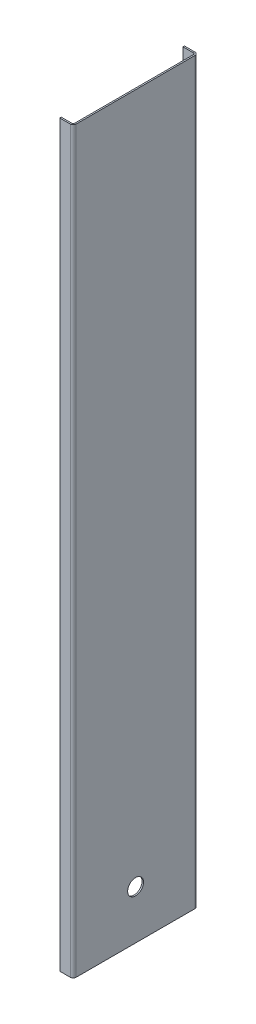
ISO-10303-21;
HEADER;
FILE_DESCRIPTION(('STEP AP214'),'2;1');
FILE_NAME('part.step','',(''),(''),'','','');
FILE_SCHEMA(('AUTOMOTIVE_DESIGN { 1 0 10303 214 1 1 1 1 }'));
ENDSEC;
DATA;
#1=APPLICATION_CONTEXT('core data for automotive mechanical design processes');
#2=APPLICATION_PROTOCOL_DEFINITION('international standard','automotive_design',2000,#1);
#3=PRODUCT_CONTEXT('',#1,'mechanical');
#4=PRODUCT('Part','Part','',(#3));
#5=PRODUCT_RELATED_PRODUCT_CATEGORY('part','',(#4));
#6=PRODUCT_DEFINITION_FORMATION('','',#4);
#7=PRODUCT_DEFINITION_CONTEXT('part definition',#1,'design');
#8=PRODUCT_DEFINITION('design','',#6,#7);
#9=PRODUCT_DEFINITION_SHAPE('','',#8);
#10=(LENGTH_UNIT() NAMED_UNIT(*) SI_UNIT(.MILLI.,.METRE.));
#11=(NAMED_UNIT(*) PLANE_ANGLE_UNIT() SI_UNIT($,.RADIAN.));
#12=(NAMED_UNIT(*) SI_UNIT($,.STERADIAN.) SOLID_ANGLE_UNIT());
#13=UNCERTAINTY_MEASURE_WITH_UNIT(LENGTH_MEASURE(1.E-05),#10,'distance_accuracy_value','');
#14=(GEOMETRIC_REPRESENTATION_CONTEXT(3) GLOBAL_UNCERTAINTY_ASSIGNED_CONTEXT((#13)) GLOBAL_UNIT_ASSIGNED_CONTEXT((#10,
#11,#12)) REPRESENTATION_CONTEXT('',''));
#15=CARTESIAN_POINT('',(0.,0.,0.));
#16=DIRECTION('',(0.,0.,1.));
#17=DIRECTION('',(1.,0.,0.));
#18=AXIS2_PLACEMENT_3D('',#15,#16,#17);
#19=CARTESIAN_POINT('',(430.000000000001,274.,102.3));
#20=DIRECTION('',(0.,-1.,0.));
#21=DIRECTION('',(0.,0.,-1.));
#22=AXIS2_PLACEMENT_3D('',#19,#20,#21);
#23=PLANE('',#22);
#24=DIRECTION('',(1.,0.,0.));
#25=VECTOR('',#24,1.);
#26=CARTESIAN_POINT('',(428.800000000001,274.,99.9000000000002));
#27=LINE('',#26,#25);
#28=CARTESIAN_POINT('',(428.800000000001,274.,99.9000000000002));
#29=VERTEX_POINT('',#28);
#30=CARTESIAN_POINT('',(430.000000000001,274.,99.9000000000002));
#31=VERTEX_POINT('',#30);
#32=EDGE_CURVE('E223',#29,#31,#27,.T.);
#33=ORIENTED_EDGE('',*,*,#32,.T.);
#34=DIRECTION('',(0.,0.,1.));
#35=VECTOR('',#34,1.);
#36=CARTESIAN_POINT('',(430.,274.,-1.42079482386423E-12));
#37=LINE('',#36,#35);
#38=CARTESIAN_POINT('',(430.,274.,2.39999999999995));
#39=VERTEX_POINT('',#38);
#40=EDGE_CURVE('E238',#39,#31,#37,.T.);
#41=ORIENTED_EDGE('',*,*,#40,.F.);
#42=DIRECTION('',(-1.,0.,0.));
#43=VECTOR('',#42,1.);
#44=CARTESIAN_POINT('',(428.8,274.,2.39999999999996));
#45=LINE('',#44,#43);
#46=CARTESIAN_POINT('',(428.8,274.,2.39999999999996));
#47=VERTEX_POINT('',#46);
#48=EDGE_CURVE('E246',#47,#39,#45,.F.);
#49=ORIENTED_EDGE('',*,*,#48,.F.);
#50=DIRECTION('',(0.,0.,-1.));
#51=VECTOR('',#50,1.);
#52=CARTESIAN_POINT('',(428.800000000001,274.,102.3));
#53=LINE('',#52,#51);
#54=EDGE_CURVE('E242',#47,#29,#53,.F.);
#55=ORIENTED_EDGE('',*,*,#54,.T.);
#56=EDGE_LOOP('',(#33,#41,#49,#55));
#57=FACE_BOUND('',#56,.T.);
#58=ADVANCED_FACE('F77',(#57),#23,.F.);
#59=CARTESIAN_POINT('',(430.,-332.3,1.2));
#60=DIRECTION('',(0.,1.,0.));
#61=DIRECTION('',(0.,0.,1.));
#62=AXIS2_PLACEMENT_3D('',#59,#60,#61);
#63=PLANE('',#62);
#64=DIRECTION('',(1.,-1.85037170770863E-13,0.));
#65=VECTOR('',#64,1.);
#66=CARTESIAN_POINT('',(428.800000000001,-332.3,99.9000000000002));
#67=LINE('',#66,#65);
#68=CARTESIAN_POINT('',(428.800000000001,-332.3,99.9000000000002));
#69=VERTEX_POINT('',#68);
#70=CARTESIAN_POINT('',(430.000000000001,-332.3,99.9000000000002));
#71=VERTEX_POINT('',#70);
#72=EDGE_CURVE('E229',#69,#71,#67,.T.);
#73=ORIENTED_EDGE('',*,*,#72,.F.);
#74=DIRECTION('',(0.,0.,1.));
#75=VECTOR('',#74,1.);
#76=CARTESIAN_POINT('',(428.8,-332.3,1.2));
#77=LINE('',#76,#75);
#78=CARTESIAN_POINT('',(428.8,-332.3,2.39999999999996));
#79=VERTEX_POINT('',#78);
#80=EDGE_CURVE('E240',#69,#79,#77,.F.);
#81=ORIENTED_EDGE('',*,*,#80,.T.);
#82=DIRECTION('',(-1.,0.,0.));
#83=VECTOR('',#82,1.);
#84=CARTESIAN_POINT('',(430.,-332.3,2.39999999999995));
#85=LINE('',#84,#83);
#86=CARTESIAN_POINT('',(430.,-332.3,2.39999999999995));
#87=VERTEX_POINT('',#86);
#88=EDGE_CURVE('E232',#79,#87,#85,.F.);
#89=ORIENTED_EDGE('',*,*,#88,.T.);
#90=DIRECTION('',(0.,0.,-1.));
#91=VECTOR('',#90,1.);
#92=CARTESIAN_POINT('',(430.,-332.3,-1.42079482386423E-12));
#93=LINE('',#92,#91);
#94=EDGE_CURVE('E235',#71,#87,#93,.T.);
#95=ORIENTED_EDGE('',*,*,#94,.F.);
#96=EDGE_LOOP('',(#73,#81,#89,#95));
#97=FACE_BOUND('',#96,.T.);
#98=ADVANCED_FACE('F355',(#97),#63,.F.);
#99=CARTESIAN_POINT('',(430.,0.,-1.42079482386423E-12));
#100=DIRECTION('',(-1.,0.,0.));
#101=DIRECTION('',(0.,0.,1.));
#102=AXIS2_PLACEMENT_3D('',#99,#100,#101);
#103=PLANE('',#102);
#104=CARTESIAN_POINT('',(430.,-292.3,51.1500000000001));
#105=DIRECTION('',(-1.,0.,0.));
#106=DIRECTION('',(0.,0.,1.));
#107=AXIS2_PLACEMENT_3D('',#104,#105,#106);
#108=CIRCLE('',#107,6.50000000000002);
#109=CARTESIAN_POINT('',(430.,-292.3,57.6500000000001));
#110=VERTEX_POINT('',#109);
#111=EDGE_CURVE('E220',#110,#110,#108,.T.);
#112=ORIENTED_EDGE('',*,*,#111,.T.);
#113=EDGE_LOOP('',(#112));
#114=FACE_BOUND('',#113,.T.);
#115=DIRECTION('',(0.,1.,0.));
#116=VECTOR('',#115,1.);
#117=CARTESIAN_POINT('',(430.000000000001,274.,99.9000000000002));
#118=LINE('',#117,#116);
#119=EDGE_CURVE('E176',#31,#71,#118,.F.);
#120=ORIENTED_EDGE('',*,*,#119,.T.);
#121=ORIENTED_EDGE('',*,*,#94,.T.);
#122=DIRECTION('',(0.,1.,0.));
#123=VECTOR('',#122,1.);
#124=CARTESIAN_POINT('',(430.,-332.3,2.39999999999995));
#125=LINE('',#124,#123);
#126=EDGE_CURVE('E244',#39,#87,#125,.F.);
#127=ORIENTED_EDGE('',*,*,#126,.F.);
#128=ORIENTED_EDGE('',*,*,#40,.T.);
#129=EDGE_LOOP('',(#120,#121,#127,#128));
#130=FACE_BOUND('',#129,.T.);
#131=ADVANCED_FACE('F340',(#114,#130),#103,.F.);
#132=CARTESIAN_POINT('',(428.8,0.,-1.41660504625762E-12));
#133=DIRECTION('',(-1.,0.,0.));
#134=DIRECTION('',(0.,0.,1.));
#135=AXIS2_PLACEMENT_3D('',#132,#133,#134);
#136=PLANE('',#135);
#137=CARTESIAN_POINT('',(428.8,-292.3,51.1500000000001));
#138=DIRECTION('',(-1.,0.,0.));
#139=DIRECTION('',(0.,0.,1.));
#140=AXIS2_PLACEMENT_3D('',#137,#138,#139);
#141=CIRCLE('',#140,6.50000000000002);
#142=CARTESIAN_POINT('',(428.8,-292.3,57.6500000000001));
#143=VERTEX_POINT('',#142);
#144=EDGE_CURVE('E334',#143,#143,#141,.T.);
#145=ORIENTED_EDGE('',*,*,#144,.F.);
#146=EDGE_LOOP('',(#145));
#147=FACE_BOUND('',#146,.T.);
#148=ORIENTED_EDGE('',*,*,#80,.F.);
#149=DIRECTION('',(0.,1.,0.));
#150=VECTOR('',#149,1.);
#151=CARTESIAN_POINT('',(428.800000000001,274.,99.9000000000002));
#152=LINE('',#151,#150);
#153=EDGE_CURVE('E92',#29,#69,#152,.F.);
#154=ORIENTED_EDGE('',*,*,#153,.F.);
#155=ORIENTED_EDGE('',*,*,#54,.F.);
#156=DIRECTION('',(0.,1.,0.));
#157=VECTOR('',#156,1.);
#158=CARTESIAN_POINT('',(428.8,-332.3,2.39999999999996));
#159=LINE('',#158,#157);
#160=EDGE_CURVE('E249',#79,#47,#159,.T.);
#161=ORIENTED_EDGE('',*,*,#160,.F.);
#162=EDGE_LOOP('',(#148,#154,#155,#161));
#163=FACE_BOUND('',#162,.T.);
#164=ADVANCED_FACE('F313',(#147,#163),#136,.T.);
#165=CARTESIAN_POINT('',(419.,-332.3,1.2));
#166=DIRECTION('',(0.,1.,0.));
#167=DIRECTION('',(0.,0.,1.));
#168=AXIS2_PLACEMENT_3D('',#165,#166,#167);
#169=PLANE('',#168);
#170=DIRECTION('',(0.,0.,-1.));
#171=VECTOR('',#170,1.);
#172=CARTESIAN_POINT('',(427.6,-332.3,1.19999999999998));
#173=LINE('',#172,#171);
#174=CARTESIAN_POINT('',(427.6,-332.3,1.19999999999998));
#175=VERTEX_POINT('',#174);
#176=CARTESIAN_POINT('',(427.6,-332.3,0.));
#177=VERTEX_POINT('',#176);
#178=EDGE_CURVE('E268',#175,#177,#173,.T.);
#179=ORIENTED_EDGE('',*,*,#178,.F.);
#180=DIRECTION('',(1.,0.,0.));
#181=VECTOR('',#180,1.);
#182=CARTESIAN_POINT('',(419.,-332.3,1.2));
#183=LINE('',#182,#181);
#184=CARTESIAN_POINT('',(419.,-332.3,1.2));
#185=VERTEX_POINT('',#184);
#186=EDGE_CURVE('E276',#185,#175,#183,.T.);
#187=ORIENTED_EDGE('',*,*,#186,.F.);
#188=DIRECTION('',(0.,0.,-1.));
#189=VECTOR('',#188,1.);
#190=CARTESIAN_POINT('',(419.,-332.3,1.2));
#191=LINE('',#190,#189);
#192=CARTESIAN_POINT('',(419.,-332.3,0.));
#193=VERTEX_POINT('',#192);
#194=EDGE_CURVE('E13',#185,#193,#191,.T.);
#195=ORIENTED_EDGE('',*,*,#194,.T.);
#196=DIRECTION('',(1.,0.,0.));
#197=VECTOR('',#196,1.);
#198=CARTESIAN_POINT('',(419.,-332.3,0.));
#199=LINE('',#198,#197);
#200=EDGE_CURVE('E284',#193,#177,#199,.T.);
#201=ORIENTED_EDGE('',*,*,#200,.T.);
#202=EDGE_LOOP('',(#179,#187,#195,#201));
#203=FACE_BOUND('',#202,.T.);
#204=ADVANCED_FACE('F300',(#203),#169,.F.);
#205=CARTESIAN_POINT('',(419.,274.,1.2));
#206=DIRECTION('',(0.,-1.,0.));
#207=DIRECTION('',(0.,0.,-1.));
#208=AXIS2_PLACEMENT_3D('',#205,#206,#207);
#209=PLANE('',#208);
#210=DIRECTION('',(0.,0.,-1.));
#211=VECTOR('',#210,1.);
#212=CARTESIAN_POINT('',(427.6,274.,1.19999999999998));
#213=LINE('',#212,#211);
#214=CARTESIAN_POINT('',(427.6,274.,1.19999999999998));
#215=VERTEX_POINT('',#214);
#216=CARTESIAN_POINT('',(427.6,274.,0.));
#217=VERTEX_POINT('',#216);
#218=EDGE_CURVE('E258',#215,#217,#213,.T.);
#219=ORIENTED_EDGE('',*,*,#218,.T.);
#220=DIRECTION('',(-1.,0.,0.));
#221=VECTOR('',#220,1.);
#222=CARTESIAN_POINT('',(419.,274.,0.));
#223=LINE('',#222,#221);
#224=CARTESIAN_POINT('',(419.,274.,0.));
#225=VERTEX_POINT('',#224);
#226=EDGE_CURVE('E277',#217,#225,#223,.T.);
#227=ORIENTED_EDGE('',*,*,#226,.T.);
#228=DIRECTION('',(0.,0.,-1.));
#229=VECTOR('',#228,1.);
#230=CARTESIAN_POINT('',(419.,274.,1.2));
#231=LINE('',#230,#229);
#232=CARTESIAN_POINT('',(419.,274.,1.2));
#233=VERTEX_POINT('',#232);
#234=EDGE_CURVE('E85',#233,#225,#231,.T.);
#235=ORIENTED_EDGE('',*,*,#234,.F.);
#236=DIRECTION('',(-1.,0.,0.));
#237=VECTOR('',#236,1.);
#238=CARTESIAN_POINT('',(419.,274.,1.2));
#239=LINE('',#238,#237);
#240=EDGE_CURVE('E280',#215,#233,#239,.T.);
#241=ORIENTED_EDGE('',*,*,#240,.F.);
#242=EDGE_LOOP('',(#219,#227,#235,#241));
#243=FACE_BOUND('',#242,.T.);
#244=ADVANCED_FACE('F304',(#243),#209,.F.);
#245=CARTESIAN_POINT('',(0.,0.,1.2));
#246=DIRECTION('',(0.,0.,-1.));
#247=DIRECTION('',(-1.,0.,0.));
#248=AXIS2_PLACEMENT_3D('',#245,#246,#247);
#249=PLANE('',#248);
#250=DIRECTION('',(0.,1.,0.));
#251=VECTOR('',#250,1.);
#252=CARTESIAN_POINT('',(427.6,274.,1.19999999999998));
#253=LINE('',#252,#251);
#254=EDGE_CURVE('E264',#215,#175,#253,.F.);
#255=ORIENTED_EDGE('',*,*,#254,.F.);
#256=ORIENTED_EDGE('',*,*,#240,.T.);
#257=DIRECTION('',(0.,-1.,0.));
#258=VECTOR('',#257,1.);
#259=CARTESIAN_POINT('',(419.,-332.3,1.2));
#260=LINE('',#259,#258);
#261=EDGE_CURVE('E273',#233,#185,#260,.T.);
#262=ORIENTED_EDGE('',*,*,#261,.T.);
#263=ORIENTED_EDGE('',*,*,#186,.T.);
#264=EDGE_LOOP('',(#255,#256,#262,#263));
#265=FACE_BOUND('',#264,.T.);
#266=ADVANCED_FACE('F303',(#265),#249,.F.);
#267=CARTESIAN_POINT('',(0.,0.,0.));
#268=DIRECTION('',(0.,0.,-1.));
#269=DIRECTION('',(-1.,0.,0.));
#270=AXIS2_PLACEMENT_3D('',#267,#268,#269);
#271=PLANE('',#270);
#272=ORIENTED_EDGE('',*,*,#226,.F.);
#273=DIRECTION('',(0.,1.,0.));
#274=VECTOR('',#273,1.);
#275=CARTESIAN_POINT('',(427.6,274.,0.));
#276=LINE('',#275,#274);
#277=EDGE_CURVE('E253',#217,#177,#276,.F.);
#278=ORIENTED_EDGE('',*,*,#277,.T.);
#279=ORIENTED_EDGE('',*,*,#200,.F.);
#280=DIRECTION('',(0.,-1.,0.));
#281=VECTOR('',#280,1.);
#282=CARTESIAN_POINT('',(419.,-332.3,0.));
#283=LINE('',#282,#281);
#284=EDGE_CURVE('E270',#225,#193,#283,.T.);
#285=ORIENTED_EDGE('',*,*,#284,.F.);
#286=EDGE_LOOP('',(#272,#278,#279,#285));
#287=FACE_BOUND('',#286,.T.);
#288=ADVANCED_FACE('F297',(#287),#271,.T.);
#289=CARTESIAN_POINT('',(419.,-332.3,1.2));
#290=DIRECTION('',(1.,0.,0.));
#291=DIRECTION('',(0.,0.,-1.));
#292=AXIS2_PLACEMENT_3D('',#289,#290,#291);
#293=PLANE('',#292);
#294=ORIENTED_EDGE('',*,*,#284,.T.);
#295=ORIENTED_EDGE('',*,*,#194,.F.);
#296=ORIENTED_EDGE('',*,*,#261,.F.);
#297=ORIENTED_EDGE('',*,*,#234,.T.);
#298=EDGE_LOOP('',(#294,#295,#296,#297));
#299=FACE_BOUND('',#298,.T.);
#300=ADVANCED_FACE('F79',(#299),#293,.F.);
#301=CARTESIAN_POINT('',(427.6,-332.3,2.39999999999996));
#302=DIRECTION('',(0.,-1.,0.));
#303=DIRECTION('',(0.,0.,-1.));
#304=AXIS2_PLACEMENT_3D('',#301,#302,#303);
#305=PLANE('',#304);
#306=ORIENTED_EDGE('',*,*,#88,.F.);
#307=CARTESIAN_POINT('',(427.6,-332.3,2.39999999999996));
#308=DIRECTION('',(0.,1.,0.));
#309=DIRECTION('',(0.,0.,1.));
#310=AXIS2_PLACEMENT_3D('',#307,#308,#309);
#311=CIRCLE('',#310,1.19999999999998);
#312=EDGE_CURVE('E261',#175,#79,#311,.F.);
#313=ORIENTED_EDGE('',*,*,#312,.F.);
#314=ORIENTED_EDGE('',*,*,#178,.T.);
#315=CARTESIAN_POINT('',(427.6,-332.3,2.39999999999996));
#316=DIRECTION('',(0.,1.,0.));
#317=DIRECTION('',(0.,0.,1.));
#318=AXIS2_PLACEMENT_3D('',#315,#316,#317);
#319=CIRCLE('',#318,2.39999999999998);
#320=EDGE_CURVE('E100',#177,#87,#319,.F.);
#321=ORIENTED_EDGE('',*,*,#320,.T.);
#322=EDGE_LOOP('',(#306,#313,#314,#321));
#323=FACE_BOUND('',#322,.T.);
#324=ADVANCED_FACE('F371',(#323),#305,.T.);
#325=CARTESIAN_POINT('',(427.6,274.,2.39999999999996));
#326=DIRECTION('',(0.,-1.,0.));
#327=DIRECTION('',(0.,0.,-1.));
#328=AXIS2_PLACEMENT_3D('',#325,#326,#327);
#329=PLANE('',#328);
#330=CARTESIAN_POINT('',(427.6,274.,2.39999999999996));
#331=DIRECTION('',(0.,1.,0.));
#332=DIRECTION('',(0.,0.,1.));
#333=AXIS2_PLACEMENT_3D('',#330,#331,#332);
#334=CIRCLE('',#333,1.19999999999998);
#335=EDGE_CURVE('E237',#47,#215,#334,.T.);
#336=ORIENTED_EDGE('',*,*,#335,.F.);
#337=ORIENTED_EDGE('',*,*,#48,.T.);
#338=CARTESIAN_POINT('',(427.6,274.,2.39999999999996));
#339=DIRECTION('',(0.,1.,0.));
#340=DIRECTION('',(0.,0.,1.));
#341=AXIS2_PLACEMENT_3D('',#338,#339,#340);
#342=CIRCLE('',#341,2.39999999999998);
#343=EDGE_CURVE('E256',#39,#217,#342,.T.);
#344=ORIENTED_EDGE('',*,*,#343,.T.);
#345=ORIENTED_EDGE('',*,*,#218,.F.);
#346=EDGE_LOOP('',(#336,#337,#344,#345));
#347=FACE_BOUND('',#346,.T.);
#348=ADVANCED_FACE('F307',(#347),#329,.F.);
#349=CARTESIAN_POINT('',(427.6,274.,2.39999999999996));
#350=DIRECTION('',(0.,1.,0.));
#351=DIRECTION('',(1.,0.,0.));
#352=AXIS2_PLACEMENT_3D('',#349,#350,#351);
#353=CYLINDRICAL_SURFACE('',#352,2.39999999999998);
#354=ORIENTED_EDGE('',*,*,#277,.F.);
#355=ORIENTED_EDGE('',*,*,#343,.F.);
#356=ORIENTED_EDGE('',*,*,#126,.T.);
#357=ORIENTED_EDGE('',*,*,#320,.F.);
#358=EDGE_LOOP('',(#354,#355,#356,#357));
#359=FACE_BOUND('',#358,.T.);
#360=ADVANCED_FACE('F365',(#359),#353,.T.);
#361=CARTESIAN_POINT('',(427.6,274.,2.39999999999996));
#362=DIRECTION('',(0.,1.,0.));
#363=DIRECTION('',(1.,0.,0.));
#364=AXIS2_PLACEMENT_3D('',#361,#362,#363);
#365=CYLINDRICAL_SURFACE('',#364,1.19999999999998);
#366=ORIENTED_EDGE('',*,*,#254,.T.);
#367=ORIENTED_EDGE('',*,*,#312,.T.);
#368=ORIENTED_EDGE('',*,*,#160,.T.);
#369=ORIENTED_EDGE('',*,*,#335,.T.);
#370=EDGE_LOOP('',(#366,#367,#368,#369));
#371=FACE_BOUND('',#370,.T.);
#372=ADVANCED_FACE('F310',(#371),#365,.F.);
#373=CARTESIAN_POINT('',(427.600000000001,-332.3,99.9000000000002));
#374=DIRECTION('',(0.,-1.,0.));
#375=DIRECTION('',(0.,0.,-1.));
#376=AXIS2_PLACEMENT_3D('',#373,#374,#375);
#377=PLANE('',#376);
#378=DIRECTION('',(0.,0.,1.));
#379=VECTOR('',#378,1.);
#380=CARTESIAN_POINT('',(427.600000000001,-332.3,102.3));
#381=LINE('',#380,#379);
#382=CARTESIAN_POINT('',(427.600000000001,-332.3,101.1));
#383=VERTEX_POINT('',#382);
#384=CARTESIAN_POINT('',(427.600000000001,-332.3,102.3));
#385=VERTEX_POINT('',#384);
#386=EDGE_CURVE('E217',#383,#385,#381,.T.);
#387=ORIENTED_EDGE('',*,*,#386,.F.);
#388=CARTESIAN_POINT('',(427.600000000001,-332.3,99.9000000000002));
#389=DIRECTION('',(0.,1.,0.));
#390=DIRECTION('',(0.,0.,1.));
#391=AXIS2_PLACEMENT_3D('',#388,#389,#390);
#392=CIRCLE('',#391,1.20000000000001);
#393=EDGE_CURVE('E179',#69,#383,#392,.F.);
#394=ORIENTED_EDGE('',*,*,#393,.F.);
#395=ORIENTED_EDGE('',*,*,#72,.T.);
#396=CARTESIAN_POINT('',(427.600000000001,-332.3,99.9000000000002));
#397=DIRECTION('',(0.,1.,0.));
#398=DIRECTION('',(0.,0.,1.));
#399=AXIS2_PLACEMENT_3D('',#396,#397,#398);
#400=CIRCLE('',#399,2.40000000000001);
#401=EDGE_CURVE('E222',#71,#385,#400,.F.);
#402=ORIENTED_EDGE('',*,*,#401,.T.);
#403=EDGE_LOOP('',(#387,#394,#395,#402));
#404=FACE_BOUND('',#403,.T.);
#405=ADVANCED_FACE('F370',(#404),#377,.T.);
#406=CARTESIAN_POINT('',(427.600000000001,274.,99.9000000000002));
#407=DIRECTION('',(0.,-1.,0.));
#408=DIRECTION('',(0.,0.,-1.));
#409=AXIS2_PLACEMENT_3D('',#406,#407,#408);
#410=PLANE('',#409);
#411=CARTESIAN_POINT('',(427.600000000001,274.,99.9000000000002));
#412=DIRECTION('',(0.,1.,0.));
#413=DIRECTION('',(0.,0.,1.));
#414=AXIS2_PLACEMENT_3D('',#411,#412,#413);
#415=CIRCLE('',#414,1.20000000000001);
#416=CARTESIAN_POINT('',(427.600000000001,274.,101.1));
#417=VERTEX_POINT('',#416);
#418=EDGE_CURVE('E186',#417,#29,#415,.T.);
#419=ORIENTED_EDGE('',*,*,#418,.F.);
#420=DIRECTION('',(0.,0.,1.));
#421=VECTOR('',#420,1.);
#422=CARTESIAN_POINT('',(427.600000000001,274.,101.1));
#423=LINE('',#422,#421);
#424=CARTESIAN_POINT('',(427.600000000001,274.,102.3));
#425=VERTEX_POINT('',#424);
#426=EDGE_CURVE('E183',#417,#425,#423,.T.);
#427=ORIENTED_EDGE('',*,*,#426,.T.);
#428=CARTESIAN_POINT('',(427.600000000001,274.,99.9000000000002));
#429=DIRECTION('',(0.,1.,0.));
#430=DIRECTION('',(0.,0.,1.));
#431=AXIS2_PLACEMENT_3D('',#428,#429,#430);
#432=CIRCLE('',#431,2.40000000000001);
#433=EDGE_CURVE('E169',#425,#31,#432,.T.);
#434=ORIENTED_EDGE('',*,*,#433,.T.);
#435=ORIENTED_EDGE('',*,*,#32,.F.);
#436=EDGE_LOOP('',(#419,#427,#434,#435));
#437=FACE_BOUND('',#436,.T.);
#438=ADVANCED_FACE('F184',(#437),#410,.F.);
#439=CARTESIAN_POINT('',(427.600000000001,274.,99.9000000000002));
#440=DIRECTION('',(0.,1.,0.));
#441=DIRECTION('',(0.,0.,1.));
#442=AXIS2_PLACEMENT_3D('',#439,#440,#441);
#443=CYLINDRICAL_SURFACE('',#442,2.40000000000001);
#444=ORIENTED_EDGE('',*,*,#119,.F.);
#445=ORIENTED_EDGE('',*,*,#433,.F.);
#446=DIRECTION('',(0.,1.,0.));
#447=VECTOR('',#446,1.);
#448=CARTESIAN_POINT('',(427.600000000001,0.,102.3));
#449=LINE('',#448,#447);
#450=EDGE_CURVE('E174',#385,#425,#449,.T.);
#451=ORIENTED_EDGE('',*,*,#450,.F.);
#452=ORIENTED_EDGE('',*,*,#401,.F.);
#453=EDGE_LOOP('',(#444,#445,#451,#452));
#454=FACE_BOUND('',#453,.T.);
#455=ADVANCED_FACE('F171',(#454),#443,.T.);
#456=CARTESIAN_POINT('',(427.600000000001,274.,99.9000000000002));
#457=DIRECTION('',(0.,1.,0.));
#458=DIRECTION('',(0.,0.,1.));
#459=AXIS2_PLACEMENT_3D('',#456,#457,#458);
#460=CYLINDRICAL_SURFACE('',#459,1.20000000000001);
#461=ORIENTED_EDGE('',*,*,#153,.T.);
#462=ORIENTED_EDGE('',*,*,#393,.T.);
#463=DIRECTION('',(0.,-1.,0.));
#464=VECTOR('',#463,1.);
#465=CARTESIAN_POINT('',(427.600000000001,-332.3,101.1));
#466=LINE('',#465,#464);
#467=EDGE_CURVE('E191',#383,#417,#466,.F.);
#468=ORIENTED_EDGE('',*,*,#467,.T.);
#469=ORIENTED_EDGE('',*,*,#418,.T.);
#470=EDGE_LOOP('',(#461,#462,#468,#469));
#471=FACE_BOUND('',#470,.T.);
#472=ADVANCED_FACE('F317',(#471),#460,.F.);
#473=CARTESIAN_POINT('',(428.800000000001,274.,102.3));
#474=DIRECTION('',(0.,1.,0.));
#475=DIRECTION('',(0.,0.,1.));
#476=AXIS2_PLACEMENT_3D('',#473,#474,#475);
#477=PLANE('',#476);
#478=DIRECTION('',(1.,0.,0.));
#479=VECTOR('',#478,1.);
#480=CARTESIAN_POINT('',(428.800000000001,274.,102.3));
#481=LINE('',#480,#479);
#482=CARTESIAN_POINT('',(419.,274.,102.3));
#483=VERTEX_POINT('',#482);
#484=EDGE_CURVE('E198',#483,#425,#481,.T.);
#485=ORIENTED_EDGE('',*,*,#484,.T.);
#486=ORIENTED_EDGE('',*,*,#426,.F.);
#487=DIRECTION('',(-1.,0.,0.));
#488=VECTOR('',#487,1.);
#489=CARTESIAN_POINT('',(7.20382241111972E-13,274.,101.100000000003));
#490=LINE('',#489,#488);
#491=CARTESIAN_POINT('',(419.,274.,101.1));
#492=VERTEX_POINT('',#491);
#493=EDGE_CURVE('E201',#492,#417,#490,.F.);
#494=ORIENTED_EDGE('',*,*,#493,.F.);
#495=DIRECTION('',(0.,0.,-1.));
#496=VECTOR('',#495,1.);
#497=CARTESIAN_POINT('',(419.,274.,102.3));
#498=LINE('',#497,#496);
#499=EDGE_CURVE('E204',#483,#492,#498,.T.);
#500=ORIENTED_EDGE('',*,*,#499,.F.);
#501=EDGE_LOOP('',(#485,#486,#494,#500));
#502=FACE_BOUND('',#501,.T.);
#503=ADVANCED_FACE('F203',(#502),#477,.T.);
#504=CARTESIAN_POINT('',(419.,-332.3,102.3));
#505=DIRECTION('',(0.,-1.,0.));
#506=DIRECTION('',(0.,0.,-1.));
#507=AXIS2_PLACEMENT_3D('',#504,#505,#506);
#508=PLANE('',#507);
#509=DIRECTION('',(1.,0.,0.));
#510=VECTOR('',#509,1.);
#511=CARTESIAN_POINT('',(7.20382241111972E-13,-332.3,101.100000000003));
#512=LINE('',#511,#510);
#513=CARTESIAN_POINT('',(419.,-332.3,101.1));
#514=VERTEX_POINT('',#513);
#515=EDGE_CURVE('E210',#383,#514,#512,.F.);
#516=ORIENTED_EDGE('',*,*,#515,.F.);
#517=ORIENTED_EDGE('',*,*,#386,.T.);
#518=DIRECTION('',(-1.,0.,0.));
#519=VECTOR('',#518,1.);
#520=CARTESIAN_POINT('',(419.,-332.3,102.3));
#521=LINE('',#520,#519);
#522=CARTESIAN_POINT('',(419.,-332.3,102.3));
#523=VERTEX_POINT('',#522);
#524=EDGE_CURVE('E200',#385,#523,#521,.T.);
#525=ORIENTED_EDGE('',*,*,#524,.T.);
#526=DIRECTION('',(0.,0.,-1.));
#527=VECTOR('',#526,1.);
#528=CARTESIAN_POINT('',(419.,-332.3,102.3));
#529=LINE('',#528,#527);
#530=EDGE_CURVE('E327',#523,#514,#529,.T.);
#531=ORIENTED_EDGE('',*,*,#530,.T.);
#532=EDGE_LOOP('',(#516,#517,#525,#531));
#533=FACE_BOUND('',#532,.T.);
#534=ADVANCED_FACE('F325',(#533),#508,.T.);
#535=CARTESIAN_POINT('',(7.28525335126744E-13,0.,102.300000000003));
#536=DIRECTION('',(0.,0.,1.));
#537=DIRECTION('',(1.,0.,0.));
#538=AXIS2_PLACEMENT_3D('',#535,#536,#537);
#539=PLANE('',#538);
#540=ORIENTED_EDGE('',*,*,#524,.F.);
#541=ORIENTED_EDGE('',*,*,#450,.T.);
#542=ORIENTED_EDGE('',*,*,#484,.F.);
#543=DIRECTION('',(0.,1.,0.));
#544=VECTOR('',#543,1.);
#545=CARTESIAN_POINT('',(419.,274.,102.3));
#546=LINE('',#545,#544);
#547=EDGE_CURVE('E207',#523,#483,#546,.T.);
#548=ORIENTED_EDGE('',*,*,#547,.F.);
#549=EDGE_LOOP('',(#540,#541,#542,#548));
#550=FACE_BOUND('',#549,.T.);
#551=ADVANCED_FACE('F196',(#550),#539,.T.);
#552=CARTESIAN_POINT('',(7.20382241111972E-13,0.,101.100000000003));
#553=DIRECTION('',(0.,0.,1.));
#554=DIRECTION('',(1.,0.,0.));
#555=AXIS2_PLACEMENT_3D('',#552,#553,#554);
#556=PLANE('',#555);
#557=ORIENTED_EDGE('',*,*,#467,.F.);
#558=ORIENTED_EDGE('',*,*,#515,.T.);
#559=DIRECTION('',(0.,-1.,0.));
#560=VECTOR('',#559,1.);
#561=CARTESIAN_POINT('',(419.,0.,101.1));
#562=LINE('',#561,#560);
#563=EDGE_CURVE('E205',#514,#492,#562,.F.);
#564=ORIENTED_EDGE('',*,*,#563,.T.);
#565=ORIENTED_EDGE('',*,*,#493,.T.);
#566=EDGE_LOOP('',(#557,#558,#564,#565));
#567=FACE_BOUND('',#566,.T.);
#568=ADVANCED_FACE('F322',(#567),#556,.F.);
#569=CARTESIAN_POINT('',(419.,274.,102.3));
#570=DIRECTION('',(-1.,0.,0.));
#571=DIRECTION('',(0.,0.,1.));
#572=AXIS2_PLACEMENT_3D('',#569,#570,#571);
#573=PLANE('',#572);
#574=ORIENTED_EDGE('',*,*,#563,.F.);
#575=ORIENTED_EDGE('',*,*,#530,.F.);
#576=ORIENTED_EDGE('',*,*,#547,.T.);
#577=ORIENTED_EDGE('',*,*,#499,.T.);
#578=EDGE_LOOP('',(#574,#575,#576,#577));
#579=FACE_BOUND('',#578,.T.);
#580=ADVANCED_FACE('F331',(#579),#573,.T.);
#581=CARTESIAN_POINT('',(430.,-292.3,51.1500000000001));
#582=DIRECTION('',(-1.,0.,0.));
#583=DIRECTION('',(0.,0.,1.));
#584=AXIS2_PLACEMENT_3D('',#581,#582,#583);
#585=CYLINDRICAL_SURFACE('',#584,6.50000000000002);
#586=ORIENTED_EDGE('',*,*,#111,.F.);
#587=EDGE_LOOP('',(#586));
#588=FACE_BOUND('',#587,.T.);
#589=ORIENTED_EDGE('',*,*,#144,.T.);
#590=EDGE_LOOP('',(#589));
#591=FACE_BOUND('',#590,.T.);
#592=ADVANCED_FACE('F343',(#588,#591),#585,.F.);
#593=CLOSED_SHELL('',(#58,#98,#131,#164,#204,#244,#266,#288,#300,#324,#348,#360,#372,#405,#438,
#455,#472,#503,#534,#551,#568,#580,#592));
#594=MANIFOLD_SOLID_BREP('B2',#593);
#595=ADVANCED_BREP_SHAPE_REPRESENTATION('',(#18,#594),#14);
#596=SHAPE_DEFINITION_REPRESENTATION(#9,#595);
ENDSEC;
END-ISO-10303-21;
